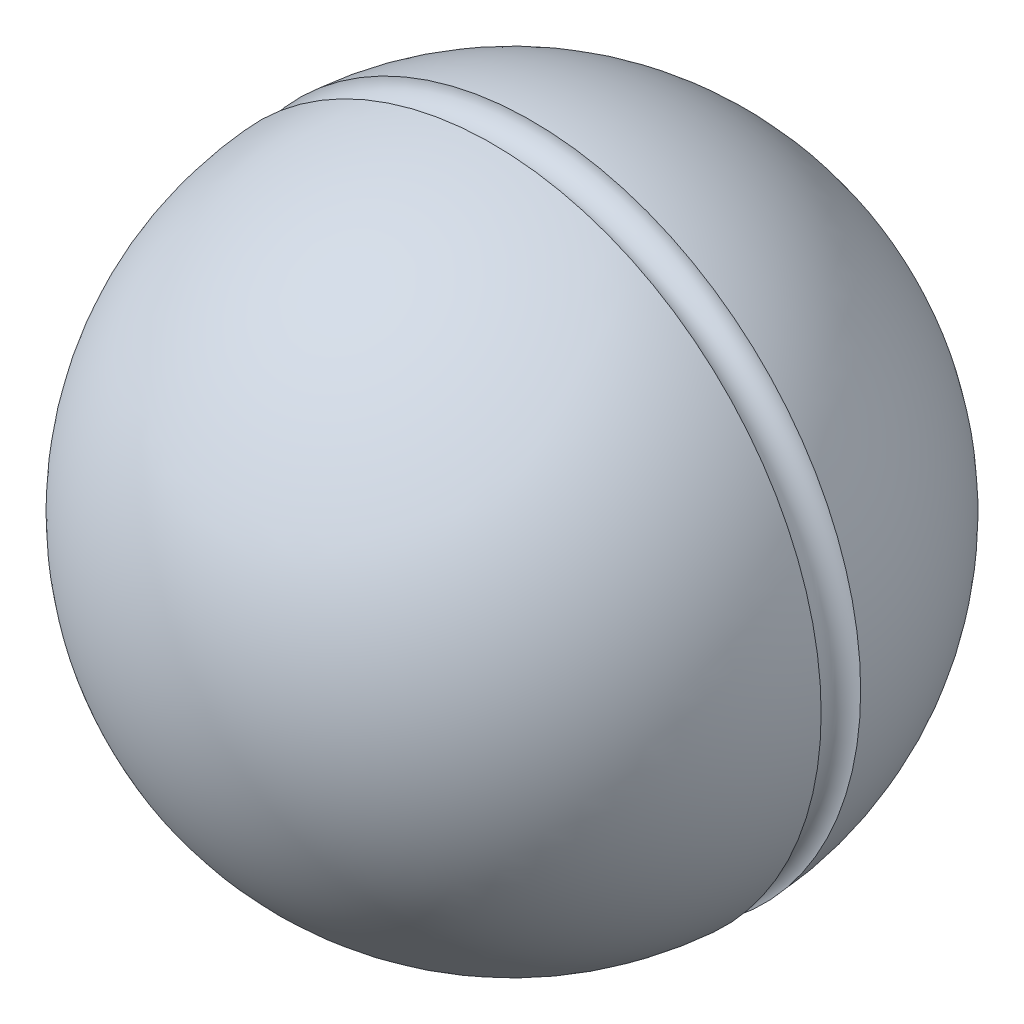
ISO-10303-21;
HEADER;
FILE_DESCRIPTION(('STEP AP214'),'2;1');
FILE_NAME('part.step','',(''),(''),'','','');
FILE_SCHEMA(('AUTOMOTIVE_DESIGN { 1 0 10303 214 1 1 1 1 }'));
ENDSEC;
DATA;
#1=APPLICATION_CONTEXT('core data for automotive mechanical design processes');
#2=APPLICATION_PROTOCOL_DEFINITION('international standard','automotive_design',2000,#1);
#3=PRODUCT_CONTEXT('',#1,'mechanical');
#4=PRODUCT('Part','Part','',(#3));
#5=PRODUCT_RELATED_PRODUCT_CATEGORY('part','',(#4));
#6=PRODUCT_DEFINITION_FORMATION('','',#4);
#7=PRODUCT_DEFINITION_CONTEXT('part definition',#1,'design');
#8=PRODUCT_DEFINITION('design','',#6,#7);
#9=PRODUCT_DEFINITION_SHAPE('','',#8);
#10=(LENGTH_UNIT() NAMED_UNIT(*) SI_UNIT(.MILLI.,.METRE.));
#11=(NAMED_UNIT(*) PLANE_ANGLE_UNIT() SI_UNIT($,.RADIAN.));
#12=(NAMED_UNIT(*) SI_UNIT($,.STERADIAN.) SOLID_ANGLE_UNIT());
#13=UNCERTAINTY_MEASURE_WITH_UNIT(LENGTH_MEASURE(1.E-05),#10,'distance_accuracy_value','');
#14=(GEOMETRIC_REPRESENTATION_CONTEXT(3) GLOBAL_UNCERTAINTY_ASSIGNED_CONTEXT((#13)) GLOBAL_UNIT_ASSIGNED_CONTEXT((#10,
#11,#12)) REPRESENTATION_CONTEXT('',''));
#15=CARTESIAN_POINT('',(0.,0.,0.));
#16=DIRECTION('',(0.,0.,1.));
#17=DIRECTION('',(1.,0.,0.));
#18=AXIS2_PLACEMENT_3D('',#15,#16,#17);
#19=CARTESIAN_POINT('',(0.,0.,11.4564392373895));
#20=DIRECTION('',(-1.,0.,0.));
#21=DIRECTION('',(0.,0.,1.));
#22=AXIS2_PLACEMENT_3D('',#19,#20,#21);
#23=SPHERICAL_SURFACE('',#22,12.5);
#24=CARTESIAN_POINT('',(0.,0.,11.4564392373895));
#25=DIRECTION('',(0.,0.,1.));
#26=DIRECTION('',(1.,0.,0.));
#27=AXIS2_PLACEMENT_3D('',#24,#25,#26);
#28=SPHERICAL_SURFACE('',#27,12.5);
#29=CARTESIAN_POINT('',(0.,0.,0.));
#30=DIRECTION('',(0.,0.,1.));
#31=DIRECTION('',(1.,0.,0.));
#32=AXIS2_PLACEMENT_3D('',#29,#30,#31);
#33=CIRCLE('',#32,5.);
#34=CARTESIAN_POINT('',(5.,0.,0.));
#35=VERTEX_POINT('',#34);
#36=EDGE_CURVE('E8',#35,#35,#33,.T.);
#37=ORIENTED_EDGE('',*,*,#36,.T.);
#38=EDGE_LOOP('',(#37));
#39=FACE_BOUND('',#38,.T.);
#40=CARTESIAN_POINT('',(0.,0.,10.7067768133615));
#41=DIRECTION('',(0.,0.,1.));
#42=DIRECTION('',(1.,0.,0.));
#43=AXIS2_PLACEMENT_3D('',#40,#41,#42);
#44=CIRCLE('',#43,12.4775);
#45=CARTESIAN_POINT('',(12.4775,0.,10.7067768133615));
#46=VERTEX_POINT('',#45);
#47=EDGE_CURVE('E31',#46,#46,#44,.T.);
#48=ORIENTED_EDGE('',*,*,#47,.F.);
#49=EDGE_LOOP('',(#48));
#50=FACE_BOUND('',#49,.T.);
#51=ADVANCED_FACE('F12',(#39,#50),#28,.T.);
#52=CARTESIAN_POINT('',(0.,3.,0.));
#53=DIRECTION('',(0.,0.,1.));
#54=DIRECTION('',(1.,0.,0.));
#55=AXIS2_PLACEMENT_3D('',#52,#53,#54);
#56=PLANE('',#55);
#57=ORIENTED_EDGE('',*,*,#36,.F.);
#58=EDGE_LOOP('',(#57));
#59=FACE_BOUND('',#58,.T.);
#60=CARTESIAN_POINT('',(0.,0.,0.));
#61=DIRECTION('',(0.,0.,1.));
#62=DIRECTION('',(1.,0.,0.));
#63=AXIS2_PLACEMENT_3D('',#60,#61,#62);
#64=CIRCLE('',#63,3.);
#65=CARTESIAN_POINT('',(3.,0.,0.));
#66=VERTEX_POINT('',#65);
#67=EDGE_CURVE('E18',#66,#66,#64,.T.);
#68=ORIENTED_EDGE('',*,*,#67,.T.);
#69=EDGE_LOOP('',(#68));
#70=FACE_BOUND('',#69,.T.);
#71=ADVANCED_FACE('F38',(#59,#70),#56,.F.);
#72=CARTESIAN_POINT('',(0.,0.,28.956023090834));
#73=DIRECTION('',(0.,0.,1.));
#74=DIRECTION('',(1.,0.,0.));
#75=AXIS2_PLACEMENT_3D('',#72,#73,#74);
#76=CYLINDRICAL_SURFACE('',#75,3.);
#77=CARTESIAN_POINT('',(0.,0.,13.));
#78=DIRECTION('',(0.,0.,1.));
#79=DIRECTION('',(1.,0.,0.));
#80=AXIS2_PLACEMENT_3D('',#77,#78,#79);
#81=CIRCLE('',#80,3.);
#82=CARTESIAN_POINT('',(3.,0.,13.));
#83=VERTEX_POINT('',#82);
#84=EDGE_CURVE('E22',#83,#83,#81,.T.);
#85=ORIENTED_EDGE('',*,*,#84,.T.);
#86=EDGE_LOOP('',(#85));
#87=FACE_BOUND('',#86,.T.);
#88=ORIENTED_EDGE('',*,*,#67,.F.);
#89=EDGE_LOOP('',(#88));
#90=FACE_BOUND('',#89,.T.);
#91=ADVANCED_FACE('F43',(#87,#90),#76,.F.);
#92=CARTESIAN_POINT('',(0.,3.,13.));
#93=DIRECTION('',(0.,0.,-1.));
#94=DIRECTION('',(-1.,0.,0.));
#95=AXIS2_PLACEMENT_3D('',#92,#93,#94);
#96=PLANE('',#95);
#97=ORIENTED_EDGE('',*,*,#84,.F.);
#98=EDGE_LOOP('',(#97));
#99=FACE_BOUND('',#98,.T.);
#100=ADVANCED_FACE('F48',(#99),#96,.T.);
#101=CARTESIAN_POINT('',(0.,0.,11.4564392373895));
#102=DIRECTION('',(-1.,0.,0.));
#103=DIRECTION('',(0.,0.,1.));
#104=AXIS2_PLACEMENT_3D('',#101,#102,#103);
#105=SPHERICAL_SURFACE('',#104,12.5);
#106=CARTESIAN_POINT('',(0.,0.,11.4564392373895));
#107=DIRECTION('',(0.,0.,1.));
#108=DIRECTION('',(1.,0.,0.));
#109=AXIS2_PLACEMENT_3D('',#106,#107,#108);
#110=SPHERICAL_SURFACE('',#109,12.5);
#111=CARTESIAN_POINT('',(0.,0.,12.206101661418));
#112=DIRECTION('',(0.,0.,1.));
#113=DIRECTION('',(1.,0.,0.));
#114=AXIS2_PLACEMENT_3D('',#111,#112,#113);
#115=CIRCLE('',#114,12.4775);
#116=CARTESIAN_POINT('',(12.4775,0.,12.206101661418));
#117=VERTEX_POINT('',#116);
#118=EDGE_CURVE('E26',#117,#117,#115,.T.);
#119=ORIENTED_EDGE('',*,*,#118,.T.);
#120=EDGE_LOOP('',(#119));
#121=FACE_BOUND('',#120,.T.);
#122=ADVANCED_FACE('F54',(#121),#110,.T.);
#123=CARTESIAN_POINT('',(0.,0.,11.4564392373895));
#124=DIRECTION('',(0.,0.,1.));
#125=DIRECTION('',(1.,0.,0.));
#126=AXIS2_PLACEMENT_3D('',#123,#124,#125);
#127=TOROIDAL_SURFACE('',#126,12.5243426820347,0.751124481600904);
#128=ORIENTED_EDGE('',*,*,#118,.F.);
#129=EDGE_LOOP('',(#128));
#130=FACE_BOUND('',#129,.T.);
#131=ORIENTED_EDGE('',*,*,#47,.T.);
#132=EDGE_LOOP('',(#131));
#133=FACE_BOUND('',#132,.T.);
#134=ADVANCED_FACE('F35',(#130,#133),#127,.F.);
#135=CLOSED_SHELL('',(#51,#71,#91,#100,#122,#134));
#136=MANIFOLD_SOLID_BREP('B1',#135);
#137=ADVANCED_BREP_SHAPE_REPRESENTATION('',(#18,#136),#14);
#138=SHAPE_DEFINITION_REPRESENTATION(#9,#137);
ENDSEC;
END-ISO-10303-21;
